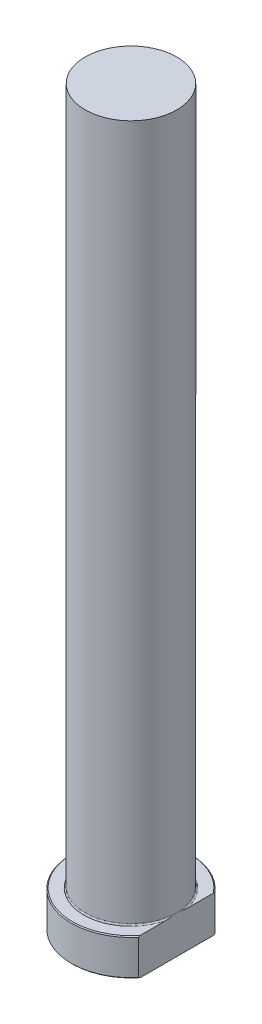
ISO-10303-21;
HEADER;
FILE_DESCRIPTION(('STEP AP214'),'2;1');
FILE_NAME('part.step','',(''),(''),'','','');
FILE_SCHEMA(('AUTOMOTIVE_DESIGN { 1 0 10303 214 1 1 1 1 }'));
ENDSEC;
DATA;
#1=APPLICATION_CONTEXT('core data for automotive mechanical design processes');
#2=APPLICATION_PROTOCOL_DEFINITION('international standard','automotive_design',2000,#1);
#3=PRODUCT_CONTEXT('',#1,'mechanical');
#4=PRODUCT('Part','Part','',(#3));
#5=PRODUCT_RELATED_PRODUCT_CATEGORY('part','',(#4));
#6=PRODUCT_DEFINITION_FORMATION('','',#4);
#7=PRODUCT_DEFINITION_CONTEXT('part definition',#1,'design');
#8=PRODUCT_DEFINITION('design','',#6,#7);
#9=PRODUCT_DEFINITION_SHAPE('','',#8);
#10=(LENGTH_UNIT() NAMED_UNIT(*) SI_UNIT(.MILLI.,.METRE.));
#11=(NAMED_UNIT(*) PLANE_ANGLE_UNIT() SI_UNIT($,.RADIAN.));
#12=(NAMED_UNIT(*) SI_UNIT($,.STERADIAN.) SOLID_ANGLE_UNIT());
#13=UNCERTAINTY_MEASURE_WITH_UNIT(LENGTH_MEASURE(1.E-05),#10,'distance_accuracy_value','');
#14=(GEOMETRIC_REPRESENTATION_CONTEXT(3) GLOBAL_UNCERTAINTY_ASSIGNED_CONTEXT((#13)) GLOBAL_UNIT_ASSIGNED_CONTEXT((#10,
#11,#12)) REPRESENTATION_CONTEXT('',''));
#15=CARTESIAN_POINT('',(0.,0.,0.));
#16=DIRECTION('',(0.,0.,1.));
#17=DIRECTION('',(1.,0.,0.));
#18=AXIS2_PLACEMENT_3D('',#15,#16,#17);
#19=CARTESIAN_POINT('',(0.,0.,0.));
#20=DIRECTION('',(0.,-1.,0.));
#21=DIRECTION('',(0.,0.,-1.));
#22=AXIS2_PLACEMENT_3D('',#19,#20,#21);
#23=PLANE('',#22);
#24=CARTESIAN_POINT('',(0.,0.,0.));
#25=DIRECTION('',(0.,-1.,0.));
#26=DIRECTION('',(0.,0.,-1.));
#27=AXIS2_PLACEMENT_3D('',#24,#25,#26);
#28=CIRCLE('',#27,12.8);
#29=CARTESIAN_POINT('',(9.99999999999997,0.,7.98999374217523));
#30=VERTEX_POINT('',#29);
#31=CARTESIAN_POINT('',(9.99999999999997,0.,-7.98999374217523));
#32=VERTEX_POINT('',#31);
#33=EDGE_CURVE('E98',#30,#32,#28,.T.);
#34=ORIENTED_EDGE('',*,*,#33,.T.);
#35=DIRECTION('',(0.,0.,1.));
#36=VECTOR('',#35,1.);
#37=CARTESIAN_POINT('',(9.99999999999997,0.,-8.30662386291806));
#38=LINE('',#37,#36);
#39=EDGE_CURVE('E83',#32,#30,#38,.T.);
#40=ORIENTED_EDGE('',*,*,#39,.T.);
#41=EDGE_LOOP('',(#34,#40));
#42=FACE_BOUND('',#41,.T.);
#43=ADVANCED_FACE('F32',(#42),#23,.T.);
#44=CARTESIAN_POINT('',(0.,259.958771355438,0.));
#45=DIRECTION('',(0.,1.,0.));
#46=DIRECTION('',(0.,0.,1.));
#47=AXIS2_PLACEMENT_3D('',#44,#45,#46);
#48=CYLINDRICAL_SURFACE('',#47,13.);
#49=CARTESIAN_POINT('',(0.,7.80000000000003,0.));
#50=DIRECTION('',(0.,1.,0.));
#51=DIRECTION('',(0.,0.,1.));
#52=AXIS2_PLACEMENT_3D('',#49,#50,#51);
#53=CIRCLE('',#52,13.);
#54=CARTESIAN_POINT('',(9.99999999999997,7.80000000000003,8.30662386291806));
#55=VERTEX_POINT('',#54);
#56=CARTESIAN_POINT('',(9.99999999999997,7.80000000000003,-8.30662386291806));
#57=VERTEX_POINT('',#56);
#58=EDGE_CURVE('E104',#55,#57,#53,.F.);
#59=ORIENTED_EDGE('',*,*,#58,.T.);
#60=DIRECTION('',(0.,-1.,0.));
#61=VECTOR('',#60,1.);
#62=CARTESIAN_POINT('',(9.99999999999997,160.,-8.30662386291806));
#63=LINE('',#62,#61);
#64=CARTESIAN_POINT('',(9.99999999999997,0.200000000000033,-8.30662386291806));
#65=VERTEX_POINT('',#64);
#66=EDGE_CURVE('E183',#57,#65,#63,.T.);
#67=ORIENTED_EDGE('',*,*,#66,.T.);
#68=CARTESIAN_POINT('',(0.,0.200000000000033,0.));
#69=DIRECTION('',(0.,-1.,0.));
#70=DIRECTION('',(0.,0.,-1.));
#71=AXIS2_PLACEMENT_3D('',#68,#69,#70);
#72=CIRCLE('',#71,13.);
#73=CARTESIAN_POINT('',(9.99999999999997,0.200000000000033,8.30662386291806));
#74=VERTEX_POINT('',#73);
#75=EDGE_CURVE('E100',#65,#74,#72,.F.);
#76=ORIENTED_EDGE('',*,*,#75,.T.);
#77=DIRECTION('',(0.,-1.,0.));
#78=VECTOR('',#77,1.);
#79=CARTESIAN_POINT('',(9.99999999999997,160.,8.30662386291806));
#80=LINE('',#79,#78);
#81=EDGE_CURVE('E93',#55,#74,#80,.T.);
#82=ORIENTED_EDGE('',*,*,#81,.F.);
#83=EDGE_LOOP('',(#59,#67,#76,#82));
#84=FACE_BOUND('',#83,.T.);
#85=ADVANCED_FACE('F158',(#84),#48,.T.);
#86=CARTESIAN_POINT('',(-13.,8.,0.));
#87=DIRECTION('',(0.,1.,0.));
#88=DIRECTION('',(0.,0.,1.));
#89=AXIS2_PLACEMENT_3D('',#86,#87,#88);
#90=PLANE('',#89);
#91=CARTESIAN_POINT('',(0.,8.,0.));
#92=DIRECTION('',(0.,1.,0.));
#93=DIRECTION('',(0.,0.,1.));
#94=AXIS2_PLACEMENT_3D('',#91,#92,#93);
#95=CIRCLE('',#94,12.8);
#96=CARTESIAN_POINT('',(9.99999999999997,8.,-7.98999374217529));
#97=VERTEX_POINT('',#96);
#98=CARTESIAN_POINT('',(9.99999999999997,8.,7.98999374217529));
#99=VERTEX_POINT('',#98);
#100=EDGE_CURVE('E178',#97,#99,#95,.T.);
#101=ORIENTED_EDGE('',*,*,#100,.T.);
#102=DIRECTION('',(0.,0.,-1.));
#103=VECTOR('',#102,1.);
#104=CARTESIAN_POINT('',(9.99999999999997,8.,0.));
#105=LINE('',#104,#103);
#106=CARTESIAN_POINT('',(9.99999999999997,7.99999999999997,2.46779253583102));
#107=VERTEX_POINT('',#106);
#108=EDGE_CURVE('E57',#99,#107,#105,.T.);
#109=ORIENTED_EDGE('',*,*,#108,.T.);
#110=CARTESIAN_POINT('',(0.,8.,0.));
#111=DIRECTION('',(0.,1.,0.));
#112=DIRECTION('',(0.,0.,1.));
#113=AXIS2_PLACEMENT_3D('',#110,#111,#112);
#114=CIRCLE('',#113,10.3);
#115=CARTESIAN_POINT('',(9.99999999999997,7.99999999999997,-2.4677925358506));
#116=VERTEX_POINT('',#115);
#117=EDGE_CURVE('E107',#107,#116,#114,.F.);
#118=ORIENTED_EDGE('',*,*,#117,.T.);
#119=EDGE_CURVE('E136',#116,#97,#105,.T.);
#120=ORIENTED_EDGE('',*,*,#119,.T.);
#121=EDGE_LOOP('',(#101,#109,#118,#120));
#122=FACE_BOUND('',#121,.T.);
#123=ADVANCED_FACE('F147',(#122),#90,.T.);
#124=CARTESIAN_POINT('',(0.,8.00000000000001,0.));
#125=DIRECTION('',(0.,-1.,0.));
#126=DIRECTION('',(0.,0.,-1.));
#127=AXIS2_PLACEMENT_3D('',#124,#125,#126);
#128=CONICAL_SURFACE('',#127,12.8,0.785398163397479);
#129=ORIENTED_EDGE('',*,*,#58,.F.);
#130=CARTESIAN_POINT('',(9.99999999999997,-0.0325156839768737,18.2754947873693));
#131=CARTESIAN_POINT('',(9.99999999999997,0.202654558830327,18.0074110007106));
#132=CARTESIAN_POINT('',(9.99999999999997,0.437161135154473,17.7387434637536));
#133=CARTESIAN_POINT('',(9.99999999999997,0.904653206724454,17.2000818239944));
#134=CARTESIAN_POINT('',(9.99999999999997,1.13763868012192,16.930087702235));
#135=CARTESIAN_POINT('',(9.99999999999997,1.6019891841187,16.3885035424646));
#136=CARTESIAN_POINT('',(9.99999999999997,1.83335346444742,16.1169128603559));
#137=CARTESIAN_POINT('',(9.99999999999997,2.29410614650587,15.5720644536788));
#138=CARTESIAN_POINT('',(9.99999999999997,2.52349455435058,15.2988067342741));
#139=CARTESIAN_POINT('',(9.99999999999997,3.21725580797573,14.4654539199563));
#140=CARTESIAN_POINT('',(9.99999999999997,3.67808931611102,13.9023903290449));
#141=CARTESIAN_POINT('',(9.99999999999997,4.35978968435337,13.050261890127));
#142=CARTESIAN_POINT('',(9.99999999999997,4.58540795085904,12.764994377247));
#143=CARTESIAN_POINT('',(9.99999999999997,5.03290011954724,12.1915402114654));
#144=CARTESIAN_POINT('',(9.99999999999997,5.25477408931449,11.9033536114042));
#145=CARTESIAN_POINT('',(9.99999999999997,5.69431250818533,11.3233226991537));
#146=CARTESIAN_POINT('',(9.99999999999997,5.9119724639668,11.0314749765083));
#147=CARTESIAN_POINT('',(9.99999999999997,6.34197664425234,10.4438760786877));
#148=CARTESIAN_POINT('',(9.99999999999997,6.55432081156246,10.1481248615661));
#149=CARTESIAN_POINT('',(9.99999999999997,6.97275454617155,9.55185224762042));
#150=CARTESIAN_POINT('',(9.99999999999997,7.17883878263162,9.25132709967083));
#151=CARTESIAN_POINT('',(9.99999999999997,7.58314110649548,8.64502234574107));
#152=CARTESIAN_POINT('',(9.99999999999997,7.78135936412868,8.33924285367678));
#153=CARTESIAN_POINT('',(9.99999999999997,8.16699130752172,7.72335702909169));
#154=CARTESIAN_POINT('',(9.99999999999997,8.35446043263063,7.41328556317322));
#155=CARTESIAN_POINT('',(9.99999999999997,8.7175057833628,6.7861665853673));
#156=CARTESIAN_POINT('',(9.99999999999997,8.89308056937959,6.4691182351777));
#157=CARTESIAN_POINT('',(9.99999999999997,9.22907765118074,5.82759086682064));
#158=CARTESIAN_POINT('',(9.99999999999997,9.38952050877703,5.50312269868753));
#159=CARTESIAN_POINT('',(9.99999999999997,9.69166927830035,4.84563633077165));
#160=CARTESIAN_POINT('',(9.99999999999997,9.83338220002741,4.5126213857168));
#161=CARTESIAN_POINT('',(9.99999999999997,10.0965229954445,3.8296241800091));
#162=CARTESIAN_POINT('',(9.99999999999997,10.2174003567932,3.47942732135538));
#163=CARTESIAN_POINT('',(9.99999999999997,10.4289934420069,2.7698616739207));
#164=CARTESIAN_POINT('',(9.99999999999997,10.5197138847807,2.41049432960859));
#165=CARTESIAN_POINT('',(9.99999999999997,10.6286544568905,1.86748514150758));
#166=CARTESIAN_POINT('',(9.99999999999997,10.6603769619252,1.68649705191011));
#167=CARTESIAN_POINT('',(9.99999999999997,10.7144435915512,1.32313476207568));
#168=CARTESIAN_POINT('',(9.99999999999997,10.7367891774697,1.14076078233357));
#169=CARTESIAN_POINT('',(9.99999999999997,10.7716587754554,0.775084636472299));
#170=CARTESIAN_POINT('',(9.99999999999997,10.7841833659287,0.59178252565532));
#171=CARTESIAN_POINT('',(9.99999999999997,10.7991548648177,0.224764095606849));
#172=CARTESIAN_POINT('',(9.99999999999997,10.801601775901,0.041047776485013));
#173=CARTESIAN_POINT('',(9.99999999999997,10.7963538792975,-0.32701731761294));
#174=CARTESIAN_POINT('',(9.99999999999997,10.7886160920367,-0.511365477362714));
#175=CARTESIAN_POINT('',(9.99999999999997,10.763087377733,-0.879387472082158));
#176=CARTESIAN_POINT('',(9.99999999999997,10.7452949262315,-1.06306120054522));
#177=CARTESIAN_POINT('',(9.99999999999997,10.7000178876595,-1.42920996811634));
#178=CARTESIAN_POINT('',(9.99999999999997,10.6725330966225,-1.61168498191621));
#179=CARTESIAN_POINT('',(9.99999999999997,10.6083992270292,-1.97502817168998));
#180=CARTESIAN_POINT('',(9.99999999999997,10.5717486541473,-2.15589608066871));
#181=CARTESIAN_POINT('',(9.99999999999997,10.4483311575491,-2.69844589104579));
#182=CARTESIAN_POINT('',(9.99999999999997,10.3484702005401,-3.0571987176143));
#183=CARTESIAN_POINT('',(9.99999999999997,10.1199208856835,-3.76518322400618));
#184=CARTESIAN_POINT('',(9.99999999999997,9.99123071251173,-4.1144143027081));
#185=CARTESIAN_POINT('',(9.99999999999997,9.68849468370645,-4.85781703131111));
#186=CARTESIAN_POINT('',(9.99999999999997,9.51049481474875,-5.25036497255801));
#187=CARTESIAN_POINT('',(9.99999999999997,9.13067200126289,-6.02385434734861));
#188=CARTESIAN_POINT('',(9.99999999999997,8.92883580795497,-6.40478917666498));
#189=CARTESIAN_POINT('',(9.99999999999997,8.50660482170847,-7.15714025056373));
#190=CARTESIAN_POINT('',(9.99999999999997,8.28617401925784,-7.52853612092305));
#191=CARTESIAN_POINT('',(9.99999999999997,7.83133827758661,-8.26251132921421));
#192=CARTESIAN_POINT('',(9.99999999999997,7.59693601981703,-8.62509234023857));
#193=CARTESIAN_POINT('',(9.99999999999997,7.1158672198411,-9.34492022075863));
#194=CARTESIAN_POINT('',(9.99999999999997,6.86913954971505,-9.70212604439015));
#195=CARTESIAN_POINT('',(9.99999999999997,6.36695123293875,-10.4103413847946));
#196=CARTESIAN_POINT('',(9.99999999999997,6.11149026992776,-10.7613506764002));
#197=CARTESIAN_POINT('',(9.99999999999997,5.59387477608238,-11.4577672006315));
#198=CARTESIAN_POINT('',(9.99999999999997,5.33172815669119,-11.803180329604));
#199=CARTESIAN_POINT('',(9.99999999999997,4.80177954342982,-12.4896197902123));
#200=CARTESIAN_POINT('',(9.99999999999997,4.53397765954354,-12.8306462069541));
#201=CARTESIAN_POINT('',(9.99999999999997,3.91508653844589,-13.6077378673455));
#202=CARTESIAN_POINT('',(9.99999999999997,3.56244770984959,-14.0425677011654));
#203=CARTESIAN_POINT('',(9.99999999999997,2.85099084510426,-14.9072873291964));
#204=CARTESIAN_POINT('',(9.99999999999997,2.49217148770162,-15.337176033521));
#205=CARTESIAN_POINT('',(9.99999999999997,1.77449197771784,-16.1870689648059));
#206=CARTESIAN_POINT('',(9.99999999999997,1.41569709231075,-16.6071284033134));
#207=CARTESIAN_POINT('',(9.99999999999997,0.694277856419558,-17.4437464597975));
#208=CARTESIAN_POINT('',(9.99999999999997,0.331654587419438,-17.8603060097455));
#209=CARTESIAN_POINT('',(9.99999999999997,-0.0325156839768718,-18.2754947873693));
#210=B_SPLINE_CURVE_WITH_KNOTS('',3,(#130,#131,#132,#133,#134,#135,#136,#137,#138,#139,#140,
#141,#142,#143,#144,#145,#146,#147,#148,#149,#150,#151,#152,#153,#154,#155,#156,#157,#158,#159,
#160,#161,#162,#163,#164,#165,#166,#167,#168,#169,#170,#171,#172,#173,#174,#175,#176,#177,#178,
#179,#180,#181,#182,#183,#184,#185,#186,#187,#188,#189,#190,#191,#192,#193,#194,#195,#196,#197,
#198,#199,#200,#201,#202,#203,#204,#205,#206,#207,#208,#209),.UNSPECIFIED.,.F.,.F.,(4,2,2,2,2,2,
2,2,2,2,2,2,2,2,2,2,2,2,2,2,2,2,2,2,2,2,2,2,2,2,2,2,2,2,2,2,2,2,2,4),(0.,1.06984422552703,
2.139703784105,3.21002948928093,4.28035188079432,6.46299853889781,7.55408928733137,
8.64516032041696,9.73733693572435,10.8295252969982,11.9226190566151,13.0156891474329,
14.1024911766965,15.1894245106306,16.274858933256,17.3598859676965,18.470231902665,
19.580404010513,20.1314403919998,20.6823908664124,21.2333088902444,21.7842267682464,
22.3374769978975,22.8908111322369,23.4441569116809,23.9975929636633,25.1131246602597,
26.2287266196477,27.5206979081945,28.813390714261,30.1086470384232,31.4036555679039,
32.7058891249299,34.0081699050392,35.308975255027,36.6097553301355,38.2892289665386,
39.9690662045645,41.6263430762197,43.2831636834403),.UNSPECIFIED.);
#211=EDGE_CURVE('E135',#55,#99,#210,.T.);
#212=ORIENTED_EDGE('',*,*,#211,.T.);
#213=ORIENTED_EDGE('',*,*,#100,.F.);
#214=EDGE_CURVE('E127',#97,#57,#210,.T.);
#215=ORIENTED_EDGE('',*,*,#214,.T.);
#216=EDGE_LOOP('',(#129,#212,#213,#215));
#217=FACE_BOUND('',#216,.T.);
#218=ADVANCED_FACE('F143',(#217),#128,.T.);
#219=CARTESIAN_POINT('',(0.,0.200000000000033,0.));
#220=DIRECTION('',(0.,1.,0.));
#221=DIRECTION('',(0.,0.,1.));
#222=AXIS2_PLACEMENT_3D('',#219,#220,#221);
#223=CONICAL_SURFACE('',#222,13.,0.785398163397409);
#224=ORIENTED_EDGE('',*,*,#75,.F.);
#225=CARTESIAN_POINT('',(9.99999999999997,8.03251568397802,-18.2754947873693));
#226=CARTESIAN_POINT('',(9.99999999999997,7.79734544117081,-18.0074110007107));
#227=CARTESIAN_POINT('',(9.99999999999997,7.56283886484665,-17.7387434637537));
#228=CARTESIAN_POINT('',(9.99999999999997,7.09534679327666,-17.2000818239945));
#229=CARTESIAN_POINT('',(9.99999999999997,6.86236131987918,-16.9300877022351));
#230=CARTESIAN_POINT('',(9.99999999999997,6.39801081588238,-16.3885035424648));
#231=CARTESIAN_POINT('',(9.99999999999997,6.16664653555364,-16.1169128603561));
#232=CARTESIAN_POINT('',(9.99999999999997,5.70589385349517,-15.5720644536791));
#233=CARTESIAN_POINT('',(9.99999999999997,5.47650544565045,-15.2988067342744));
#234=CARTESIAN_POINT('',(9.99999999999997,4.78274419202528,-14.4654539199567));
#235=CARTESIAN_POINT('',(9.99999999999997,4.32191068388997,-13.9023903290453));
#236=CARTESIAN_POINT('',(9.99999999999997,3.64021031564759,-13.0502618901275));
#237=CARTESIAN_POINT('',(9.99999999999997,3.41459204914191,-12.7649943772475));
#238=CARTESIAN_POINT('',(9.99999999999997,2.96709988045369,-12.1915402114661));
#239=CARTESIAN_POINT('',(9.99999999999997,2.74522591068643,-11.9033536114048));
#240=CARTESIAN_POINT('',(9.99999999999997,2.30568749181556,-11.3233226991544));
#241=CARTESIAN_POINT('',(9.99999999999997,2.08802753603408,-11.0314749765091));
#242=CARTESIAN_POINT('',(9.99999999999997,1.65802335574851,-10.4438760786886));
#243=CARTESIAN_POINT('',(9.99999999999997,1.44567918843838,-10.148124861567));
#244=CARTESIAN_POINT('',(9.99999999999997,1.02724545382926,-9.55185224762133));
#245=CARTESIAN_POINT('',(9.99999999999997,0.821161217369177,-9.25132709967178));
#246=CARTESIAN_POINT('',(9.99999999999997,0.416858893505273,-8.64502234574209));
#247=CARTESIAN_POINT('',(9.99999999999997,0.218640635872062,-8.33924285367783));
#248=CARTESIAN_POINT('',(9.99999999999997,-0.166991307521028,-7.72335702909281));
#249=CARTESIAN_POINT('',(9.99999999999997,-0.354460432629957,-7.41328556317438));
#250=CARTESIAN_POINT('',(9.99999999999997,-0.717505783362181,-6.78616658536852));
#251=CARTESIAN_POINT('',(9.99999999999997,-0.893080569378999,-6.46911823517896));
#252=CARTESIAN_POINT('',(9.99999999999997,-1.22907765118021,-5.82759086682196));
#253=CARTESIAN_POINT('',(9.99999999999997,-1.38952050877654,-5.50312269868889));
#254=CARTESIAN_POINT('',(9.99999999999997,-1.69166927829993,-4.84563633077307));
#255=CARTESIAN_POINT('',(9.99999999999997,-1.83338220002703,-4.51262138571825));
#256=CARTESIAN_POINT('',(9.99999999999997,-2.09652299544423,-3.82962418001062));
#257=CARTESIAN_POINT('',(9.99999999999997,-2.21740035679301,-3.47942732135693));
#258=CARTESIAN_POINT('',(9.99999999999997,-2.42899344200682,-2.76986167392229));
#259=CARTESIAN_POINT('',(9.99999999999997,-2.51971388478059,-2.41049432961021));
#260=CARTESIAN_POINT('',(9.99999999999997,-2.62865445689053,-1.86748514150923));
#261=CARTESIAN_POINT('',(9.99999999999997,-2.66037696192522,-1.68649705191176));
#262=CARTESIAN_POINT('',(9.99999999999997,-2.71444359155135,-1.32313476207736));
#263=CARTESIAN_POINT('',(9.99999999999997,-2.73678917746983,-1.14076078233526));
#264=CARTESIAN_POINT('',(9.99999999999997,-2.77165877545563,-0.775084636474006));
#265=CARTESIAN_POINT('',(9.99999999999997,-2.78418336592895,-0.591782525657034));
#266=CARTESIAN_POINT('',(9.99999999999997,-2.79915486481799,-0.224764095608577));
#267=CARTESIAN_POINT('',(9.99999999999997,-2.8016017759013,-0.0410477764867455));
#268=CARTESIAN_POINT('',(9.99999999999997,-2.79635387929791,0.327017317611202));
#269=CARTESIAN_POINT('',(9.99999999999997,-2.78861609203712,0.511365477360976));
#270=CARTESIAN_POINT('',(9.99999999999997,-2.76308737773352,0.879387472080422));
#271=CARTESIAN_POINT('',(9.99999999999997,-2.74529492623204,1.06306120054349));
#272=CARTESIAN_POINT('',(9.99999999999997,-2.70001788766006,1.42920996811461));
#273=CARTESIAN_POINT('',(9.99999999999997,-2.67253309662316,1.61168498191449));
#274=CARTESIAN_POINT('',(9.99999999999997,-2.60839922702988,1.97502817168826));
#275=CARTESIAN_POINT('',(9.99999999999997,-2.57174865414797,2.15589608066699));
#276=CARTESIAN_POINT('',(9.99999999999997,-2.4483311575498,2.69844589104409));
#277=CARTESIAN_POINT('',(9.99999999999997,-2.34847020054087,3.0571987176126));
#278=CARTESIAN_POINT('',(9.99999999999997,-2.11992088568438,3.7651832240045));
#279=CARTESIAN_POINT('',(9.99999999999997,-1.99123071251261,4.11441430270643));
#280=CARTESIAN_POINT('',(9.99999999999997,-1.68849468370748,4.85781703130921));
#281=CARTESIAN_POINT('',(9.99999999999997,-1.51049481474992,5.25036497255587));
#282=CARTESIAN_POINT('',(9.99999999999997,-1.13067200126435,6.02385434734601));
#283=CARTESIAN_POINT('',(9.99999999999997,-0.928835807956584,6.40478917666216));
#284=CARTESIAN_POINT('',(9.99999999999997,-0.5066048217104,7.15714025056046));
#285=CARTESIAN_POINT('',(9.99999999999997,-0.286174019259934,7.52853612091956));
#286=CARTESIAN_POINT('',(9.99999999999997,0.168661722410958,8.26251132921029));
#287=CARTESIAN_POINT('',(9.99999999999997,0.403063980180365,8.62509234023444));
#288=CARTESIAN_POINT('',(9.99999999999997,0.884132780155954,9.34492022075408));
#289=CARTESIAN_POINT('',(9.99999999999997,1.13086045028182,9.70212604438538));
#290=CARTESIAN_POINT('',(9.99999999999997,1.63304876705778,10.4103413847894));
#291=CARTESIAN_POINT('',(9.99999999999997,1.8885097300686,10.7613506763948));
#292=CARTESIAN_POINT('',(9.99999999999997,2.40612522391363,11.4577672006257));
#293=CARTESIAN_POINT('',(9.99999999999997,2.66827184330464,11.803180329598));
#294=CARTESIAN_POINT('',(9.99999999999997,3.19822045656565,12.4896197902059));
#295=CARTESIAN_POINT('',(9.99999999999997,3.46602234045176,12.8306462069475));
#296=CARTESIAN_POINT('',(9.99999999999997,4.0849134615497,13.6077378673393));
#297=CARTESIAN_POINT('',(9.99999999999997,4.43755229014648,14.0425677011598));
#298=CARTESIAN_POINT('',(9.99999999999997,5.14900915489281,14.907287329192));
#299=CARTESIAN_POINT('',(9.99999999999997,5.50782851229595,15.3371760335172));
#300=CARTESIAN_POINT('',(9.99999999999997,6.22550802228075,16.1870689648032));
#301=CARTESIAN_POINT('',(9.99999999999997,6.58430290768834,16.6071284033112));
#302=CARTESIAN_POINT('',(9.99999999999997,7.30572214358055,17.4437464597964));
#303=CARTESIAN_POINT('',(9.99999999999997,7.66834541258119,17.860306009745));
#304=CARTESIAN_POINT('',(9.99999999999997,8.03251568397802,18.2754947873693));
#305=B_SPLINE_CURVE_WITH_KNOTS('',3,(#225,#226,#227,#228,#229,#230,#231,#232,#233,#234,#235,
#236,#237,#238,#239,#240,#241,#242,#243,#244,#245,#246,#247,#248,#249,#250,#251,#252,#253,#254,
#255,#256,#257,#258,#259,#260,#261,#262,#263,#264,#265,#266,#267,#268,#269,#270,#271,#272,#273,
#274,#275,#276,#277,#278,#279,#280,#281,#282,#283,#284,#285,#286,#287,#288,#289,#290,#291,#292,
#293,#294,#295,#296,#297,#298,#299,#300,#301,#302,#303,#304),.UNSPECIFIED.,.F.,.F.,(4,2,2,2,2,2,
2,2,2,2,2,2,2,2,2,2,2,2,2,2,2,2,2,2,2,2,2,2,2,2,2,2,2,2,2,2,2,2,2,4),(0.,1.06984422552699,
2.13970378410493,3.21002948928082,4.28035188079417,6.46299853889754,7.55408928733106,
8.64516032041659,9.73733693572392,10.8295252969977,11.9226190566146,13.0156891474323,
14.1024911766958,15.1894245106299,16.2748589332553,17.3598859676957,18.4702319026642,
19.5804040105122,20.1314403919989,20.6823908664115,21.2333088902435,21.7842267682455,
22.3374769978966,22.890811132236,23.44415691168,23.9975929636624,25.1131246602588,
26.2287266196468,27.5206979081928,28.8133907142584,30.1086470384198,31.4036555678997,
32.7058891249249,34.0081699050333,35.3089752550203,36.609755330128,38.2892289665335,
39.9690662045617,41.6263430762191,43.2831636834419),.UNSPECIFIED.);
#306=EDGE_CURVE('E86',#65,#32,#305,.T.);
#307=ORIENTED_EDGE('',*,*,#306,.T.);
#308=ORIENTED_EDGE('',*,*,#33,.F.);
#309=EDGE_CURVE('E89',#30,#74,#305,.T.);
#310=ORIENTED_EDGE('',*,*,#309,.T.);
#311=EDGE_LOOP('',(#224,#307,#308,#310));
#312=FACE_BOUND('',#311,.T.);
#313=ADVANCED_FACE('F97',(#312),#223,.T.);
#314=CARTESIAN_POINT('',(0.,8.29999999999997,0.));
#315=DIRECTION('',(0.,1.,0.));
#316=DIRECTION('',(0.,0.,1.));
#317=AXIS2_PLACEMENT_3D('',#314,#315,#316);
#318=TOROIDAL_SURFACE('',#317,10.3,0.3);
#319=CARTESIAN_POINT('',(9.99999999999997,8.29999999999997,0.));
#320=CARTESIAN_POINT('',(9.99999999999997,8.3000006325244,1.2894927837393E-10));
#321=CARTESIAN_POINT('',(9.99999999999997,8.30000126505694,-4.00092931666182E-07));
#322=CARTESIAN_POINT('',(9.99999999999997,8.30000243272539,-1.40234418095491E-06));
#323=CARTESIAN_POINT('',(9.99999999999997,8.30000291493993,-2.02945823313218E-06));
#324=CARTESIAN_POINT('',(9.99999999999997,8.30000399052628,-3.57386628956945E-06));
#325=CARTESIAN_POINT('',(9.99999999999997,8.30000456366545,-4.5158581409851E-06));
#326=CARTESIAN_POINT('',(9.99999999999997,8.30000552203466,-6.39352358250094E-06));
#327=CARTESIAN_POINT('',(9.99999999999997,8.3000059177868,-7.32481303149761E-06));
#328=CARTESIAN_POINT('',(9.99999999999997,8.30000752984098,-1.11866731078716E-05));
#329=CARTESIAN_POINT('',(9.99999999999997,8.30000869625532,-1.41456078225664E-05));
#330=CARTESIAN_POINT('',(9.99999999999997,8.30001046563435,-1.98041770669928E-05));
#331=CARTESIAN_POINT('',(9.99999999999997,8.30001112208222,-2.2487618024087E-05));
#332=CARTESIAN_POINT('',(9.99999999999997,8.30001410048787,-3.44834818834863E-05));
#333=CARTESIAN_POINT('',(9.99999999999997,8.30001652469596,-4.37702043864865E-05));
#334=CARTESIAN_POINT('',(9.99999999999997,8.30001986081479,-6.08623690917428E-05));
#335=CARTESIAN_POINT('',(9.99999999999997,8.30002096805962,-6.86285921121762E-05));
#336=CARTESIAN_POINT('',(9.99999999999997,8.3000293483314,-0.00012805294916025));
#337=CARTESIAN_POINT('',(9.99999999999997,8.30003610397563,-0.000179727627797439));
#338=CARTESIAN_POINT('',(9.99999999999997,8.30006561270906,-0.00038619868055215));
#339=CARTESIAN_POINT('',(9.99999999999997,8.30009331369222,-0.000540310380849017));
#340=CARTESIAN_POINT('',(9.99999999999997,8.30020264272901,-0.00115673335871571));
#341=CARTESIAN_POINT('',(9.99999999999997,8.30028138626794,-0.00161935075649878));
#342=CARTESIAN_POINT('',(9.99999999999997,8.30059961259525,-0.00347761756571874));
#343=CARTESIAN_POINT('',(9.99999999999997,8.30084290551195,-0.0048728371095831));
#344=CARTESIAN_POINT('',(9.99999999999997,8.30186502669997,-0.0107472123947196));
#345=CARTESIAN_POINT('',(9.99999999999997,8.30263902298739,-0.0152269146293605));
#346=CARTESIAN_POINT('',(9.99999999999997,8.31278939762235,-0.0739588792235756));
#347=CARTESIAN_POINT('',(9.99999999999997,8.32219581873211,-0.128207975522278));
#348=CARTESIAN_POINT('',(9.99999999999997,8.34198671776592,-0.242894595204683));
#349=CARTESIAN_POINT('',(9.99999999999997,8.35236068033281,-0.303333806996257));
#350=CARTESIAN_POINT('',(9.99999999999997,8.3697713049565,-0.405616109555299));
#351=CARTESIAN_POINT('',(9.99999999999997,8.3768514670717,-0.447451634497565));
#352=CARTESIAN_POINT('',(9.99999999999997,8.39069208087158,-0.529918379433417));
#353=CARTESIAN_POINT('',(9.99999999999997,8.39745582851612,-0.570549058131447));
#354=CARTESIAN_POINT('',(9.99999999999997,8.4352494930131,-0.799879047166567));
#355=CARTESIAN_POINT('',(9.99999999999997,8.46492511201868,-0.988816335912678));
#356=CARTESIAN_POINT('',(9.99999999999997,8.50514159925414,-1.27416595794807));
#357=CARTESIAN_POINT('',(9.99999999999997,8.51790226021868,-1.37026272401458));
#358=CARTESIAN_POINT('',(9.99999999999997,8.54137601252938,-1.56269877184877));
#359=CARTESIAN_POINT('',(9.99999999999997,8.55208934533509,-1.65903802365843));
#360=CARTESIAN_POINT('',(9.99999999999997,8.57171635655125,-1.86082905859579));
#361=CARTESIAN_POINT('',(9.99999999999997,8.58037484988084,-1.96630619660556));
#362=CARTESIAN_POINT('',(9.99999999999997,8.59347501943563,-2.17764173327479));
#363=CARTESIAN_POINT('',(9.99999999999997,8.59791297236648,-2.28350038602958));
#364=CARTESIAN_POINT('',(9.99999999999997,8.60018116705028,-2.44194031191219));
#365=CARTESIAN_POINT('',(9.99999999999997,8.60021412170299,-2.49449016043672));
#366=CARTESIAN_POINT('',(9.99999999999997,8.5985468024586,-2.59955991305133));
#367=CARTESIAN_POINT('',(9.99999999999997,8.59684676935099,-2.65207982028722));
#368=CARTESIAN_POINT('',(9.99999999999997,8.59132943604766,-2.7569292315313));
#369=CARTESIAN_POINT('',(9.99999999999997,8.58751547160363,-2.80925890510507));
#370=CARTESIAN_POINT('',(9.99999999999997,8.57721394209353,-2.91364681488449));
#371=CARTESIAN_POINT('',(9.99999999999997,8.57072778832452,-2.96570517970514));
#372=CARTESIAN_POINT('',(9.99999999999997,8.55845909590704,-3.04236198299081));
#373=CARTESIAN_POINT('',(9.99999999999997,8.55406015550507,-3.06718232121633));
#374=CARTESIAN_POINT('',(9.99999999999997,8.54426309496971,-3.11664708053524));
#375=CARTESIAN_POINT('',(9.99999999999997,8.53886425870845,-3.14129136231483));
#376=CARTESIAN_POINT('',(9.99999999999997,8.52688550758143,-3.19015398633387));
#377=CARTESIAN_POINT('',(9.99999999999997,8.52031210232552,-3.21437390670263));
#378=CARTESIAN_POINT('',(9.99999999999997,8.50565284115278,-3.26234404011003));
#379=CARTESIAN_POINT('',(9.99999999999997,8.49756823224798,-3.2860946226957));
#380=CARTESIAN_POINT('',(9.99999999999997,8.47930616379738,-3.33303874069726));
#381=CARTESIAN_POINT('',(9.99999999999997,8.46910978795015,-3.35622496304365));
#382=CARTESIAN_POINT('',(9.99999999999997,8.44583688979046,-3.40109767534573));
#383=CARTESIAN_POINT('',(9.99999999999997,8.43277518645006,-3.4227911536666));
#384=CARTESIAN_POINT('',(9.99999999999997,8.41234422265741,-3.44947282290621));
#385=CARTESIAN_POINT('',(9.99999999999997,8.40696910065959,-3.45597309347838));
#386=CARTESIAN_POINT('',(9.99999999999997,8.39560437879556,-3.46843629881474));
#387=CARTESIAN_POINT('',(9.99999999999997,8.38961405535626,-3.47439858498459));
#388=CARTESIAN_POINT('',(9.99999999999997,8.37686927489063,-3.48560282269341));
#389=CARTESIAN_POINT('',(9.99999999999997,8.37010747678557,-3.49083658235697));
#390=CARTESIAN_POINT('',(9.99999999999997,8.3558159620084,-3.50012893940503));
#391=CARTESIAN_POINT('',(9.99999999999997,8.34828839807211,-3.50419071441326));
#392=CARTESIAN_POINT('',(9.99999999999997,8.33495256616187,-3.50966904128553));
#393=CARTESIAN_POINT('',(9.99999999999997,8.32932210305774,-3.5115146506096));
#394=CARTESIAN_POINT('',(9.99999999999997,8.31783314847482,-3.51424608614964));
#395=CARTESIAN_POINT('',(9.99999999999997,8.31197492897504,-3.5151330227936));
#396=CARTESIAN_POINT('',(9.99999999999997,8.30017128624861,-3.51585458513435));
#397=CARTESIAN_POINT('',(9.99999999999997,8.29422562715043,-3.5156854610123));
#398=CARTESIAN_POINT('',(9.99999999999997,8.28245600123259,-3.5143060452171));
#399=CARTESIAN_POINT('',(9.99999999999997,8.2766321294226,-3.51309496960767));
#400=CARTESIAN_POINT('',(9.99999999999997,8.26408629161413,-3.50941038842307));
#401=CARTESIAN_POINT('',(9.99999999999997,8.25742641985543,-3.50672823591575));
#402=CARTESIAN_POINT('',(9.99999999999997,8.2446282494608,-3.50032629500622));
#403=CARTESIAN_POINT('',(9.99999999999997,8.23849100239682,-3.49660447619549));
#404=CARTESIAN_POINT('',(9.99999999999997,8.22322836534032,-3.48593836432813));
#405=CARTESIAN_POINT('',(9.99999999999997,8.21452212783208,-3.47840118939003));
#406=CARTESIAN_POINT('',(9.99999999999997,8.19829740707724,-3.46215047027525));
#407=CARTESIAN_POINT('',(9.99999999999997,8.19078248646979,-3.45343353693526));
#408=CARTESIAN_POINT('',(9.99999999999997,8.16907103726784,-3.42543186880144));
#409=CARTESIAN_POINT('',(9.99999999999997,8.15646161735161,-3.40493410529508));
#410=CARTESIAN_POINT('',(9.99999999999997,8.13394130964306,-3.36256849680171));
#411=CARTESIAN_POINT('',(9.99999999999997,8.12403585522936,-3.34069800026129));
#412=CARTESIAN_POINT('',(9.99999999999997,8.10001076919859,-3.28102790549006));
#413=CARTESIAN_POINT('',(9.99999999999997,8.08762395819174,-3.24253659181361));
#414=CARTESIAN_POINT('',(9.99999999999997,8.06625855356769,-3.16459452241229));
#415=CARTESIAN_POINT('',(9.99999999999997,8.05728845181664,-3.12514163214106));
#416=CARTESIAN_POINT('',(9.99999999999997,8.04173697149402,-3.04517405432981));
#417=CARTESIAN_POINT('',(9.99999999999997,8.03519245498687,-3.00465227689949));
#418=CARTESIAN_POINT('',(9.99999999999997,8.02409415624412,-2.9234105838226));
#419=CARTESIAN_POINT('',(9.99999999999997,8.0195374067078,-2.8826910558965));
#420=CARTESIAN_POINT('',(9.99999999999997,8.00795421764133,-2.7573453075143));
#421=CARTESIAN_POINT('',(9.99999999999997,8.00352270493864,-2.67248037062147));
#422=CARTESIAN_POINT('',(9.99999999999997,7.9993551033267,-2.50262077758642));
#423=CARTESIAN_POINT('',(9.99999999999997,7.99962236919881,-2.41762607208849));
#424=CARTESIAN_POINT('',(9.99999999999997,8.00371104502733,-2.24733475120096));
#425=CARTESIAN_POINT('',(9.99999999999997,8.00754894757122,-2.16203856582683));
#426=CARTESIAN_POINT('',(9.99999999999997,8.01800314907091,-1.99161257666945));
#427=CARTESIAN_POINT('',(9.99999999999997,8.02461987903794,-1.90648280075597));
#428=CARTESIAN_POINT('',(9.99999999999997,8.04643179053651,-1.66587956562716));
#429=CARTESIAN_POINT('',(9.99999999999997,8.06418968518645,-1.51064125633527));
#430=CARTESIAN_POINT('',(9.99999999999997,8.10422160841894,-1.20249798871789));
#431=CARTESIAN_POINT('',(9.99999999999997,8.12644437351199,-1.04958602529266));
#432=CARTESIAN_POINT('',(9.99999999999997,8.15948239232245,-0.836243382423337));
#433=CARTESIAN_POINT('',(9.99999999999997,8.16909985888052,-0.775623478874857));
#434=CARTESIAN_POINT('',(9.99999999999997,8.18897079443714,-0.652687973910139));
#435=CARTESIAN_POINT('',(9.99999999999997,8.1992346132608,-0.590374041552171));
#436=CARTESIAN_POINT('',(9.99999999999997,8.21713663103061,-0.483134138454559));
#437=CARTESIAN_POINT('',(9.99999999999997,8.22471025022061,-0.438197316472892));
#438=CARTESIAN_POINT('',(9.99999999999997,8.2398772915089,-0.348851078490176));
#439=CARTESIAN_POINT('',(9.99999999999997,8.24746951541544,-0.30444145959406));
#440=CARTESIAN_POINT('',(9.99999999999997,8.26182028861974,-0.220832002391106));
#441=CARTESIAN_POINT('',(9.99999999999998,8.26857235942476,-0.181631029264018));
#442=CARTESIAN_POINT('',(9.99999999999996,8.28242621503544,-0.101524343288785));
#443=CARTESIAN_POINT('',(9.99999999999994,8.2895303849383,-0.0606190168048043));
#444=CARTESIAN_POINT('',(9.99999999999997,8.29736053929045,-0.0152203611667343));
#445=CARTESIAN_POINT('',(9.99999999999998,8.29813373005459,-0.0107340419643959));
#446=CARTESIAN_POINT('',(9.99999999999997,8.29916055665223,-0.00485912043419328));
#447=CARTESIAN_POINT('',(9.99999999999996,8.29940456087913,-0.00346907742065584));
#448=CARTESIAN_POINT('',(9.99999999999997,8.29971826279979,-0.00161621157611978));
#449=CARTESIAN_POINT('',(9.99999999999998,8.29979547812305,-0.00115451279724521));
#450=CARTESIAN_POINT('',(9.99999999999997,8.29990750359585,-0.000539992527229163));
#451=CARTESIAN_POINT('',(9.99999999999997,8.29993630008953,-0.00038627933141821));
#452=CARTESIAN_POINT('',(9.99999999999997,8.2999632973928,-0.000179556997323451));
#453=CARTESIAN_POINT('',(9.99999999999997,8.29996909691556,-0.000127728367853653));
#454=CARTESIAN_POINT('',(9.99999999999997,8.29998090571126,-5.92319127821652E-05));
#455=CARTESIAN_POINT('',(9.99999999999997,8.2999842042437,-4.21300594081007E-05));
#456=CARTESIAN_POINT('',(9.99999999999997,8.2999888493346,-2.24947629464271E-05));
#457=CARTESIAN_POINT('',(9.99999999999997,8.29998949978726,-1.98237694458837E-05));
#458=CARTESIAN_POINT('',(9.99999999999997,8.29999127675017,-1.4167154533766E-05));
#459=CARTESIAN_POINT('',(9.99999999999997,8.29999246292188,-1.11998611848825E-05));
#460=CARTESIAN_POINT('',(9.99999999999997,8.29999408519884,-7.32510164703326E-06));
#461=CARTESIAN_POINT('',(9.99999999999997,8.2999944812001,-6.39283781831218E-06));
#462=CARTESIAN_POINT('',(9.99999999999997,8.29999543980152,-4.51302258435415E-06));
#463=CARTESIAN_POINT('',(9.99999999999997,8.2999960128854,-3.56982568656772E-06));
#464=CARTESIAN_POINT('',(9.99999999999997,8.29999708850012,-2.02579406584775E-06));
#465=CARTESIAN_POINT('',(9.99999999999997,8.2999975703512,-1.39989048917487E-06));
#466=CARTESIAN_POINT('',(9.99999999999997,8.29999873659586,-3.99573162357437E-07));
#467=CARTESIAN_POINT('',(9.99999999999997,8.29999936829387,-1.2878245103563E-10));
#468=CARTESIAN_POINT('',(9.99999999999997,8.29999999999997,0.));
#469=B_SPLINE_CURVE_WITH_KNOTS('',3,(#319,#320,#321,#322,#323,#324,#325,#326,#327,#328,#329,
#330,#331,#332,#333,#334,#335,#336,#337,#338,#339,#340,#341,#342,#343,#344,#345,#346,#347,#348,
#349,#350,#351,#352,#353,#354,#355,#356,#357,#358,#359,#360,#361,#362,#363,#364,#365,#366,#367,
#368,#369,#370,#371,#372,#373,#374,#375,#376,#377,#378,#379,#380,#381,#382,#383,#384,#385,#386,
#387,#388,#389,#390,#391,#392,#393,#394,#395,#396,#397,#398,#399,#400,#401,#402,#403,#404,#405,
#406,#407,#408,#409,#410,#411,#412,#413,#414,#415,#416,#417,#418,#419,#420,#421,#422,#423,#424,
#425,#426,#427,#428,#429,#430,#431,#432,#433,#434,#435,#436,#437,#438,#439,#440,#441,#442,#443,
#444,#445,#446,#447,#448,#449,#450,#451,#452,#453,#454,#455,#456,#457,#458,#459,#460,#461,#462,
#463,#464,#465,#466,#467,#468),.UNSPECIFIED.,.T.,.F.,(4,2,2,2,2,2,2,2,2,2,2,2,2,2,2,2,2,2,2,2,2,
2,2,2,2,2,2,2,2,2,2,2,2,2,2,2,2,2,2,2,2,2,2,2,2,2,2,2,2,2,2,2,2,2,2,2,2,2,2,2,2,2,2,2,2,2,2,2,2,
2,2,2,2,2,4),(0.,1.98246532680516E-06,4.40569586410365E-06,7.67776729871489E-06,
1.071537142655E-05,2.02306846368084E-05,2.85109385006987E-05,5.727819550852E-05,
8.07917080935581E-05,0.000237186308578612,0.000706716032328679,0.00211476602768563,
0.00636329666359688,0.0200018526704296,0.18517497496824,0.369144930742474,0.496435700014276,
0.620005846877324,1.19369866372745,1.48450372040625,1.77527445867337,2.09271424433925,
2.41043381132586,2.56806178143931,2.72566785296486,2.88302592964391,3.04030100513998,
3.11590708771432,3.19156753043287,3.26682097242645,3.34201258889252,3.41790937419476,
3.49342251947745,3.51869744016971,3.54400243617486,3.56957226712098,3.5950721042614,
3.61277731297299,3.63046199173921,3.64820950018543,3.66597037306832,3.68738951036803,
3.70885077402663,3.74320167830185,3.77765344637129,3.84944920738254,3.92138819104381,
4.04238665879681,4.16368392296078,4.28675554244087,4.40964280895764,4.66436434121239,
4.91926774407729,5.17535440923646,5.43148080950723,5.90010007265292,6.36361828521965,
6.54775191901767,6.73721153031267,6.87392319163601,7.00908476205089,7.12841975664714,
7.25297120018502,7.26662883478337,7.27086249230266,7.27226698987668,7.27273594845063,
7.27289226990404,7.27294450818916,7.27295274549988,7.27296230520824,7.27296534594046,
7.27296862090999,7.27297104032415,7.27297302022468),.UNSPECIFIED.);
#470=CARTESIAN_POINT('',(9.99999999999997,8.29999999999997,0.));
#471=VERTEX_POINT('',#470);
#472=EDGE_CURVE('E11',#116,#471,#469,.T.);
#473=ORIENTED_EDGE('',*,*,#472,.F.);
#474=ORIENTED_EDGE('',*,*,#117,.F.);
#475=CARTESIAN_POINT('',(9.99999999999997,8.29999999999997,0.));
#476=CARTESIAN_POINT('',(9.99999999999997,8.29999936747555,-1.2894930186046E-10));
#477=CARTESIAN_POINT('',(9.99999999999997,8.29999873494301,4.0009293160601E-07));
#478=CARTESIAN_POINT('',(9.99999999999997,8.29999756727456,1.40234418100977E-06));
#479=CARTESIAN_POINT('',(9.99999999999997,8.29999708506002,2.02945823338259E-06));
#480=CARTESIAN_POINT('',(9.99999999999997,8.29999600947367,3.57386628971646E-06));
#481=CARTESIAN_POINT('',(9.99999999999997,8.2999954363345,4.51585814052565E-06));
#482=CARTESIAN_POINT('',(9.99999999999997,8.29999447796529,6.39352358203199E-06));
#483=CARTESIAN_POINT('',(9.99999999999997,8.29999408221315,7.32481303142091E-06));
#484=CARTESIAN_POINT('',(9.99999999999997,8.29999247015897,1.11866731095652E-05));
#485=CARTESIAN_POINT('',(9.99999999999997,8.29999130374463,1.41456078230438E-05));
#486=CARTESIAN_POINT('',(9.99999999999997,8.2999895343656,1.98041770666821E-05));
#487=CARTESIAN_POINT('',(9.99999999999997,8.29998887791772,2.24876180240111E-05));
#488=CARTESIAN_POINT('',(9.99999999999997,8.29998589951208,3.44834818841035E-05));
#489=CARTESIAN_POINT('',(9.99999999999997,8.29998347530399,4.3770204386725E-05));
#490=CARTESIAN_POINT('',(9.99999999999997,8.29998013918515,6.08623690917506E-05));
#491=CARTESIAN_POINT('',(9.99999999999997,8.29997903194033,6.8628592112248E-05));
#492=CARTESIAN_POINT('',(9.99999999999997,8.29997065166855,0.000128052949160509));
#493=CARTESIAN_POINT('',(9.99999999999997,8.29996389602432,0.000179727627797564));
#494=CARTESIAN_POINT('',(9.99999999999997,8.29993438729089,0.000386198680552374));
#495=CARTESIAN_POINT('',(9.99999999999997,8.29990668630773,0.000540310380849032));
#496=CARTESIAN_POINT('',(9.99999999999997,8.29979735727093,0.00115673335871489));
#497=CARTESIAN_POINT('',(9.99999999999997,8.29971861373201,0.00161935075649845));
#498=CARTESIAN_POINT('',(9.99999999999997,8.29940038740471,0.00347761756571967));
#499=CARTESIAN_POINT('',(9.99999999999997,8.299157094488,0.00487283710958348));
#500=CARTESIAN_POINT('',(9.99999999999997,8.29813497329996,0.0107472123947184));
#501=CARTESIAN_POINT('',(9.99999999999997,8.29736097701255,0.0152269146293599));
#502=CARTESIAN_POINT('',(9.99999999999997,8.28721060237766,0.0739588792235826));
#503=CARTESIAN_POINT('',(9.99999999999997,8.27780418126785,0.128207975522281));
#504=CARTESIAN_POINT('',(9.99999999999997,8.25801328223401,0.242894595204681));
#505=CARTESIAN_POINT('',(9.99999999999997,8.24763931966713,0.303333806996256));
#506=CARTESIAN_POINT('',(9.99999999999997,8.23022869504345,0.405616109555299));
#507=CARTESIAN_POINT('',(9.99999999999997,8.22314853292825,0.447451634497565));
#508=CARTESIAN_POINT('',(9.99999999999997,8.20930791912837,0.529918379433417));
#509=CARTESIAN_POINT('',(9.99999999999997,8.20254417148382,0.570549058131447));
#510=CARTESIAN_POINT('',(9.99999999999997,8.16475050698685,0.799879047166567));
#511=CARTESIAN_POINT('',(9.99999999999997,8.13507488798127,0.988816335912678));
#512=CARTESIAN_POINT('',(9.99999999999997,8.0948584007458,1.27416595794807));
#513=CARTESIAN_POINT('',(9.99999999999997,8.08209773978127,1.37026272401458));
#514=CARTESIAN_POINT('',(9.99999999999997,8.05862398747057,1.56269877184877));
#515=CARTESIAN_POINT('',(9.99999999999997,8.04791065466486,1.65903802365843));
#516=CARTESIAN_POINT('',(9.99999999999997,8.0282836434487,1.86082905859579));
#517=CARTESIAN_POINT('',(9.99999999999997,8.01962515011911,1.96630619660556));
#518=CARTESIAN_POINT('',(9.99999999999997,8.00652498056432,2.17764173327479));
#519=CARTESIAN_POINT('',(9.99999999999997,8.00208702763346,2.28350038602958));
#520=CARTESIAN_POINT('',(9.99999999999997,7.99981883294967,2.44194031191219));
#521=CARTESIAN_POINT('',(9.99999999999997,7.99978587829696,2.49449016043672));
#522=CARTESIAN_POINT('',(9.99999999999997,8.00145319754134,2.59955991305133));
#523=CARTESIAN_POINT('',(9.99999999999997,8.00315323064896,2.65207982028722));
#524=CARTESIAN_POINT('',(9.99999999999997,8.00867056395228,2.7569292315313));
#525=CARTESIAN_POINT('',(9.99999999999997,8.01248452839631,2.80925890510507));
#526=CARTESIAN_POINT('',(9.99999999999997,8.02278605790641,2.91364681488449));
#527=CARTESIAN_POINT('',(9.99999999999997,8.02927221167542,2.96570517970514));
#528=CARTESIAN_POINT('',(9.99999999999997,8.04154090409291,3.04236198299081));
#529=CARTESIAN_POINT('',(9.99999999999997,8.04593984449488,3.06718232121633));
#530=CARTESIAN_POINT('',(9.99999999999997,8.05573690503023,3.11664708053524));
#531=CARTESIAN_POINT('',(9.99999999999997,8.0611357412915,3.14129136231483));
#532=CARTESIAN_POINT('',(9.99999999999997,8.07311449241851,3.19015398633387));
#533=CARTESIAN_POINT('',(9.99999999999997,8.07968789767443,3.21437390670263));
#534=CARTESIAN_POINT('',(9.99999999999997,8.09434715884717,3.26234404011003));
#535=CARTESIAN_POINT('',(9.99999999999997,8.10243176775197,3.2860946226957));
#536=CARTESIAN_POINT('',(9.99999999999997,8.12069383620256,3.33303874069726));
#537=CARTESIAN_POINT('',(9.99999999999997,8.13089021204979,3.35622496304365));
#538=CARTESIAN_POINT('',(9.99999999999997,8.15416311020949,3.40109767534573));
#539=CARTESIAN_POINT('',(9.99999999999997,8.16722481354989,3.4227911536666));
#540=CARTESIAN_POINT('',(9.99999999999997,8.18765577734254,3.44947282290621));
#541=CARTESIAN_POINT('',(9.99999999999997,8.19303089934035,3.45597309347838));
#542=CARTESIAN_POINT('',(9.99999999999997,8.20439562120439,3.46843629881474));
#543=CARTESIAN_POINT('',(9.99999999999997,8.21038594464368,3.47439858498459));
#544=CARTESIAN_POINT('',(9.99999999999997,8.22313072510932,3.48560282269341));
#545=CARTESIAN_POINT('',(9.99999999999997,8.22989252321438,3.49083658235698));
#546=CARTESIAN_POINT('',(9.99999999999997,8.24418403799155,3.50012893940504));
#547=CARTESIAN_POINT('',(9.99999999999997,8.25171160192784,3.50419071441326));
#548=CARTESIAN_POINT('',(9.99999999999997,8.26504743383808,3.50966904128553));
#549=CARTESIAN_POINT('',(9.99999999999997,8.27067789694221,3.5115146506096));
#550=CARTESIAN_POINT('',(9.99999999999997,8.28216685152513,3.51424608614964));
#551=CARTESIAN_POINT('',(9.99999999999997,8.28802507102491,3.5151330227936));
#552=CARTESIAN_POINT('',(9.99999999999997,8.29982871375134,3.51585458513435));
#553=CARTESIAN_POINT('',(9.99999999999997,8.30577437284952,3.5156854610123));
#554=CARTESIAN_POINT('',(9.99999999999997,8.31754399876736,3.5143060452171));
#555=CARTESIAN_POINT('',(9.99999999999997,8.32336787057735,3.51309496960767));
#556=CARTESIAN_POINT('',(9.99999999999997,8.33591370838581,3.50941038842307));
#557=CARTESIAN_POINT('',(9.99999999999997,8.34257358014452,3.50672823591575));
#558=CARTESIAN_POINT('',(9.99999999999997,8.35537175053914,3.50032629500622));
#559=CARTESIAN_POINT('',(9.99999999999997,8.36150899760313,3.49660447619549));
#560=CARTESIAN_POINT('',(9.99999999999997,8.37677163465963,3.48593836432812));
#561=CARTESIAN_POINT('',(9.99999999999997,8.38547787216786,3.47840118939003));
#562=CARTESIAN_POINT('',(9.99999999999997,8.4017025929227,3.46215047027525));
#563=CARTESIAN_POINT('',(9.99999999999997,8.40921751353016,3.45343353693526));
#564=CARTESIAN_POINT('',(9.99999999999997,8.43092896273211,3.42543186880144));
#565=CARTESIAN_POINT('',(9.99999999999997,8.44353838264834,3.40493410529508));
#566=CARTESIAN_POINT('',(9.99999999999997,8.46605869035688,3.36256849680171));
#567=CARTESIAN_POINT('',(9.99999999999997,8.47596414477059,3.34069800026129));
#568=CARTESIAN_POINT('',(9.99999999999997,8.49998923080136,3.28102790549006));
#569=CARTESIAN_POINT('',(9.99999999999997,8.51237604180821,3.24253659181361));
#570=CARTESIAN_POINT('',(9.99999999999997,8.53374144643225,3.16459452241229));
#571=CARTESIAN_POINT('',(9.99999999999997,8.54271154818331,3.12514163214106));
#572=CARTESIAN_POINT('',(9.99999999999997,8.55826302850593,3.04517405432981));
#573=CARTESIAN_POINT('',(9.99999999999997,8.56480754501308,3.00465227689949));
#574=CARTESIAN_POINT('',(9.99999999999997,8.57590584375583,2.9234105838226));
#575=CARTESIAN_POINT('',(9.99999999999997,8.58046259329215,2.8826910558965));
#576=CARTESIAN_POINT('',(9.99999999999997,8.59204578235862,2.7573453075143));
#577=CARTESIAN_POINT('',(9.99999999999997,8.59647729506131,2.67248037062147));
#578=CARTESIAN_POINT('',(9.99999999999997,8.60064489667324,2.50262077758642));
#579=CARTESIAN_POINT('',(9.99999999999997,8.60037763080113,2.41762607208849));
#580=CARTESIAN_POINT('',(9.99999999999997,8.59628895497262,2.24733475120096));
#581=CARTESIAN_POINT('',(9.99999999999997,8.59245105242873,2.16203856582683));
#582=CARTESIAN_POINT('',(9.99999999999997,8.58199685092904,1.99161257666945));
#583=CARTESIAN_POINT('',(9.99999999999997,8.57538012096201,1.90648280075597));
#584=CARTESIAN_POINT('',(9.99999999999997,8.55356820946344,1.66587956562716));
#585=CARTESIAN_POINT('',(9.99999999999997,8.5358103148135,1.51064125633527));
#586=CARTESIAN_POINT('',(9.99999999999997,8.49577839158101,1.20249798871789));
#587=CARTESIAN_POINT('',(9.99999999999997,8.47355562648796,1.04958602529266));
#588=CARTESIAN_POINT('',(9.99999999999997,8.44051760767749,0.836243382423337));
#589=CARTESIAN_POINT('',(9.99999999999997,8.43090014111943,0.775623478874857));
#590=CARTESIAN_POINT('',(9.99999999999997,8.41102920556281,0.652687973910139));
#591=CARTESIAN_POINT('',(9.99999999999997,8.40076538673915,0.59037404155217));
#592=CARTESIAN_POINT('',(9.99999999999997,8.38286336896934,0.483134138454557));
#593=CARTESIAN_POINT('',(9.99999999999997,8.37528974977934,0.43819731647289));
#594=CARTESIAN_POINT('',(9.99999999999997,8.36012270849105,0.348851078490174));
#595=CARTESIAN_POINT('',(9.99999999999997,8.35253048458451,0.304441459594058));
#596=CARTESIAN_POINT('',(9.99999999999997,8.33817971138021,0.220832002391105));
#597=CARTESIAN_POINT('',(9.99999999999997,8.33142764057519,0.181631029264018));
#598=CARTESIAN_POINT('',(9.99999999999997,8.31757378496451,0.101524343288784));
#599=CARTESIAN_POINT('',(9.99999999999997,8.31046961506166,0.0606190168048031));
#600=CARTESIAN_POINT('',(9.99999999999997,8.3026394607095,0.0152203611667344));
#601=CARTESIAN_POINT('',(9.99999999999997,8.30186626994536,0.0107340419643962));
#602=CARTESIAN_POINT('',(9.99999999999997,8.30083944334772,0.0048591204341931));
#603=CARTESIAN_POINT('',(9.99999999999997,8.30059543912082,0.00346907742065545));
#604=CARTESIAN_POINT('',(9.99999999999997,8.30028173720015,0.00161621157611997));
#605=CARTESIAN_POINT('',(9.99999999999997,8.30020452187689,0.00115451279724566));
#606=CARTESIAN_POINT('',(9.99999999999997,8.3000924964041,0.000539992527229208));
#607=CARTESIAN_POINT('',(9.99999999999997,8.30006369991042,0.00038627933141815));
#608=CARTESIAN_POINT('',(9.99999999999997,8.30003670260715,0.000179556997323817));
#609=CARTESIAN_POINT('',(9.99999999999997,8.30003090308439,0.000127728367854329));
#610=CARTESIAN_POINT('',(9.99999999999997,8.30001909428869,5.92319127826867E-05));
#611=CARTESIAN_POINT('',(9.99999999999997,8.30001579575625,4.21300594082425E-05));
#612=CARTESIAN_POINT('',(9.99999999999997,8.30001115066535,2.24947629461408E-05));
#613=CARTESIAN_POINT('',(9.99999999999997,8.30001050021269,1.98237694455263E-05));
#614=CARTESIAN_POINT('',(9.99999999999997,8.30000872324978,1.41671545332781E-05));
#615=CARTESIAN_POINT('',(9.99999999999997,8.30000753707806,1.11998611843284E-05));
#616=CARTESIAN_POINT('',(9.99999999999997,8.30000591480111,7.32510164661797E-06));
#617=CARTESIAN_POINT('',(9.99999999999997,8.30000551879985,6.39283781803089E-06));
#618=CARTESIAN_POINT('',(9.99999999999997,8.30000456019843,4.51302258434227E-06));
#619=CARTESIAN_POINT('',(9.99999999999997,8.30000398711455,3.56982568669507E-06));
#620=CARTESIAN_POINT('',(9.99999999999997,8.30000291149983,2.02579406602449E-06));
#621=CARTESIAN_POINT('',(9.99999999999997,8.30000242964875,1.39989048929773E-06));
#622=CARTESIAN_POINT('',(9.99999999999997,8.30000126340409,3.99573162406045E-07));
#623=CARTESIAN_POINT('',(9.99999999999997,8.30000063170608,1.28782474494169E-10));
#624=CARTESIAN_POINT('',(9.99999999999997,8.29999999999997,0.));
#625=B_SPLINE_CURVE_WITH_KNOTS('',3,(#475,#476,#477,#478,#479,#480,#481,#482,#483,#484,#485,
#486,#487,#488,#489,#490,#491,#492,#493,#494,#495,#496,#497,#498,#499,#500,#501,#502,#503,#504,
#505,#506,#507,#508,#509,#510,#511,#512,#513,#514,#515,#516,#517,#518,#519,#520,#521,#522,#523,
#524,#525,#526,#527,#528,#529,#530,#531,#532,#533,#534,#535,#536,#537,#538,#539,#540,#541,#542,
#543,#544,#545,#546,#547,#548,#549,#550,#551,#552,#553,#554,#555,#556,#557,#558,#559,#560,#561,
#562,#563,#564,#565,#566,#567,#568,#569,#570,#571,#572,#573,#574,#575,#576,#577,#578,#579,#580,
#581,#582,#583,#584,#585,#586,#587,#588,#589,#590,#591,#592,#593,#594,#595,#596,#597,#598,#599,
#600,#601,#602,#603,#604,#605,#606,#607,#608,#609,#610,#611,#612,#613,#614,#615,#616,#617,#618,
#619,#620,#621,#622,#623,#624),.UNSPECIFIED.,.T.,.F.,(4,2,2,2,2,2,2,2,2,2,2,2,2,2,2,2,2,2,2,2,2,
2,2,2,2,2,2,2,2,2,2,2,2,2,2,2,2,2,2,2,2,2,2,2,2,2,2,2,2,2,2,2,2,2,2,2,2,2,2,2,2,2,2,2,2,2,2,2,2,
2,2,2,2,2,4),(0.,1.98246532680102E-06,4.4056958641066E-06,7.67776730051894E-06,
1.07153714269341E-05,2.02306846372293E-05,2.85109385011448E-05,5.72781955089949E-05,
8.07917080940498E-05,0.000237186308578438,0.000706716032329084,0.00211476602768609,
0.00636329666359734,0.0200018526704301,0.185174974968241,0.369144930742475,0.496435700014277,
0.620005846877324,1.19369866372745,1.48450372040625,1.77527445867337,2.09271424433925,
2.41043381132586,2.56806178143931,2.72566785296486,2.88302592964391,3.04030100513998,
3.11590708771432,3.19156753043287,3.26682097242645,3.34201258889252,3.41790937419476,
3.49342251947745,3.51869744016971,3.54400243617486,3.56957226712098,3.5950721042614,
3.61277731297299,3.63046199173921,3.64820950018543,3.66597037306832,3.68738951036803,
3.70885077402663,3.74320167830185,3.77765344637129,3.84944920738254,3.92138819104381,
4.04238665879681,4.16368392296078,4.28675554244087,4.40964280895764,4.66436434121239,
4.91926774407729,5.17535440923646,5.43148080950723,5.90010007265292,6.36361828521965,
6.54775191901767,6.73721153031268,6.87392319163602,7.00908476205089,7.12841975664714,
7.25297120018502,7.26662883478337,7.27086249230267,7.27226698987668,7.27273594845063,
7.27289226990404,7.27294450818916,7.27295274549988,7.27296230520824,7.27296534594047,
7.27296862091,7.27297104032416,7.27297302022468),.UNSPECIFIED.);
#626=EDGE_CURVE('E46',#471,#107,#625,.T.);
#627=ORIENTED_EDGE('',*,*,#626,.F.);
#628=CARTESIAN_POINT('',(0.,8.29999999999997,0.));
#629=DIRECTION('',(0.,1.,0.));
#630=DIRECTION('',(0.,0.,1.));
#631=AXIS2_PLACEMENT_3D('',#628,#629,#630);
#632=CIRCLE('',#631,9.99999999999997);
#633=EDGE_CURVE('E103',#471,#471,#632,.T.);
#634=ORIENTED_EDGE('',*,*,#633,.F.);
#635=EDGE_LOOP('',(#473,#474,#627,#634));
#636=FACE_BOUND('',#635,.T.);
#637=ADVANCED_FACE('F34',(#636),#318,.F.);
#638=CARTESIAN_POINT('',(0.,259.958771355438,0.));
#639=DIRECTION('',(0.,1.,0.));
#640=DIRECTION('',(0.,0.,1.));
#641=AXIS2_PLACEMENT_3D('',#638,#639,#640);
#642=CYLINDRICAL_SURFACE('',#641,9.99999999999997);
#643=ORIENTED_EDGE('',*,*,#633,.T.);
#644=EDGE_LOOP('',(#643));
#645=FACE_BOUND('',#644,.T.);
#646=CARTESIAN_POINT('',(0.,160.,0.));
#647=DIRECTION('',(0.,1.,0.));
#648=DIRECTION('',(0.,0.,1.));
#649=AXIS2_PLACEMENT_3D('',#646,#647,#648);
#650=CIRCLE('',#649,9.99999999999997);
#651=CARTESIAN_POINT('',(0.,160.,9.99999999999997));
#652=VERTEX_POINT('',#651);
#653=EDGE_CURVE('E101',#652,#652,#650,.T.);
#654=ORIENTED_EDGE('',*,*,#653,.F.);
#655=EDGE_LOOP('',(#654));
#656=FACE_BOUND('',#655,.T.);
#657=ADVANCED_FACE('F155',(#645,#656),#642,.T.);
#658=CARTESIAN_POINT('',(-9.99999999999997,160.,0.));
#659=DIRECTION('',(0.,1.,0.));
#660=DIRECTION('',(0.,0.,1.));
#661=AXIS2_PLACEMENT_3D('',#658,#659,#660);
#662=PLANE('',#661);
#663=ORIENTED_EDGE('',*,*,#653,.T.);
#664=EDGE_LOOP('',(#663));
#665=FACE_BOUND('',#664,.T.);
#666=ADVANCED_FACE('F121',(#665),#662,.T.);
#667=CARTESIAN_POINT('',(9.99999999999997,160.,-8.30662386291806));
#668=DIRECTION('',(1.,0.,0.));
#669=DIRECTION('',(0.,0.,-1.));
#670=AXIS2_PLACEMENT_3D('',#667,#668,#669);
#671=PLANE('',#670);
#672=ORIENTED_EDGE('',*,*,#66,.F.);
#673=ORIENTED_EDGE('',*,*,#214,.F.);
#674=ORIENTED_EDGE('',*,*,#119,.F.);
#675=ORIENTED_EDGE('',*,*,#472,.T.);
#676=ORIENTED_EDGE('',*,*,#626,.T.);
#677=ORIENTED_EDGE('',*,*,#108,.F.);
#678=ORIENTED_EDGE('',*,*,#211,.F.);
#679=ORIENTED_EDGE('',*,*,#81,.T.);
#680=ORIENTED_EDGE('',*,*,#309,.F.);
#681=ORIENTED_EDGE('',*,*,#39,.F.);
#682=ORIENTED_EDGE('',*,*,#306,.F.);
#683=EDGE_LOOP('',(#672,#673,#674,#675,#676,#677,#678,#679,#680,#681,#682));
#684=FACE_BOUND('',#683,.T.);
#685=ADVANCED_FACE('F85',(#684),#671,.T.);
#686=CLOSED_SHELL('',(#43,#85,#123,#218,#313,#637,#657,#666,#685));
#687=MANIFOLD_SOLID_BREP('B2',#686);
#688=ADVANCED_BREP_SHAPE_REPRESENTATION('',(#18,#687),#14);
#689=SHAPE_DEFINITION_REPRESENTATION(#9,#688);
ENDSEC;
END-ISO-10303-21;
